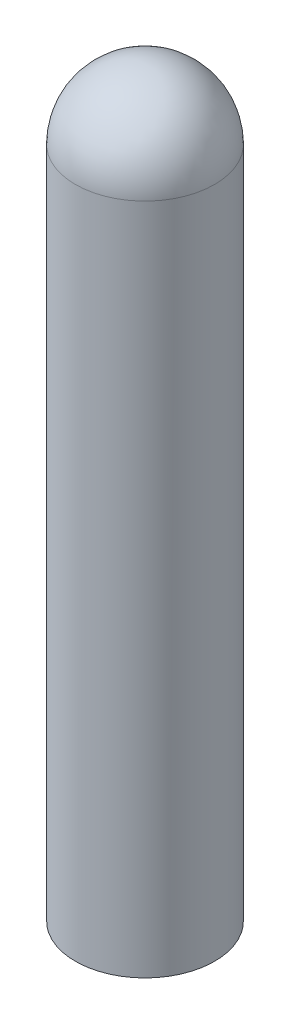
from build123d import *


with BuildPart() as part:
    # Esquisse2 → Base-R_volution (revolve)
    with BuildSketch(Plane.XY, mode=Mode.PRIVATE) as base_r_volution_sk:
        with BuildLine():
            Line((0, -10), (0, 41))
            ThreePointArc((0, 41), (2.588190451, 40.659258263), (5, 39.660254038))
            Line((5, 39.660254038), (5, -8.660254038))
            ThreePointArc((5, -8.660254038), (2.588190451, -9.659258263), (0, -10))
        make_face()
    revolve(base_r_volution_sk.sketch.rotate(Axis((0, -10, 0), (0, 1, 0)), 90), axis=Axis((0, -10, 0), (0, 1, 0)))

    # Esquisse3 → R_volution1 (revolve)
    with BuildSketch(Plane.XY):
        with BuildLine():
            Line((0, 34.660254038), (0, 44.660254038))
            ThreePointArc((0, 44.660254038), (5, 39.660254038), (0, 34.660254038))
        make_face()
    revolve(axis=Axis((0, -10, 0), (0, 1, 0)))


solid = part.part
